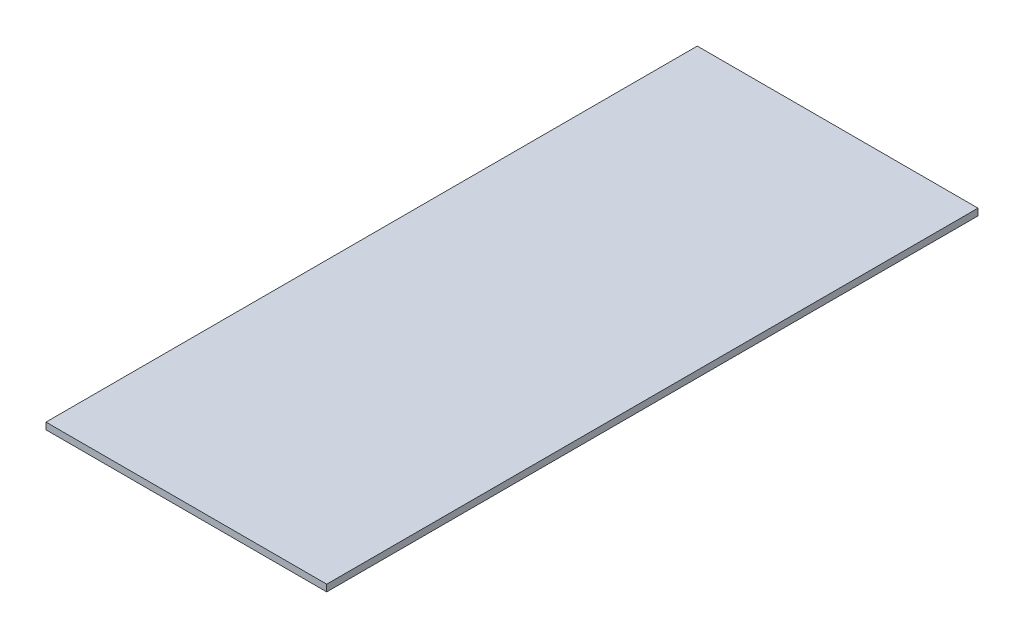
ISO-10303-21;
HEADER;
FILE_DESCRIPTION(('STEP AP214'),'2;1');
FILE_NAME('part.step','',(''),(''),'','','');
FILE_SCHEMA(('AUTOMOTIVE_DESIGN { 1 0 10303 214 1 1 1 1 }'));
ENDSEC;
DATA;
#1=APPLICATION_CONTEXT('core data for automotive mechanical design processes');
#2=APPLICATION_PROTOCOL_DEFINITION('international standard','automotive_design',2000,#1);
#3=PRODUCT_CONTEXT('',#1,'mechanical');
#4=PRODUCT('Part','Part','',(#3));
#5=PRODUCT_RELATED_PRODUCT_CATEGORY('part','',(#4));
#6=PRODUCT_DEFINITION_FORMATION('','',#4);
#7=PRODUCT_DEFINITION_CONTEXT('part definition',#1,'design');
#8=PRODUCT_DEFINITION('design','',#6,#7);
#9=PRODUCT_DEFINITION_SHAPE('','',#8);
#10=(LENGTH_UNIT() NAMED_UNIT(*) SI_UNIT(.MILLI.,.METRE.));
#11=(NAMED_UNIT(*) PLANE_ANGLE_UNIT() SI_UNIT($,.RADIAN.));
#12=(NAMED_UNIT(*) SI_UNIT($,.STERADIAN.) SOLID_ANGLE_UNIT());
#13=UNCERTAINTY_MEASURE_WITH_UNIT(LENGTH_MEASURE(1.E-05),#10,'distance_accuracy_value','');
#14=(GEOMETRIC_REPRESENTATION_CONTEXT(3) GLOBAL_UNCERTAINTY_ASSIGNED_CONTEXT((#13)) GLOBAL_UNIT_ASSIGNED_CONTEXT((#10,
#11,#12)) REPRESENTATION_CONTEXT('',''));
#15=CARTESIAN_POINT('',(0.,0.,0.));
#16=DIRECTION('',(0.,0.,1.));
#17=DIRECTION('',(1.,0.,0.));
#18=AXIS2_PLACEMENT_3D('',#15,#16,#17);
#19=CARTESIAN_POINT('',(0.,6.,0.));
#20=DIRECTION('',(1.,0.,0.));
#21=DIRECTION('',(0.,0.,-1.));
#22=AXIS2_PLACEMENT_3D('',#19,#20,#21);
#23=PLANE('',#22);
#24=DIRECTION('',(0.,0.,1.));
#25=VECTOR('',#24,1.);
#26=CARTESIAN_POINT('',(0.,0.,0.));
#27=LINE('',#26,#25);
#28=CARTESIAN_POINT('',(0.,0.,-105.));
#29=VERTEX_POINT('',#28);
#30=CARTESIAN_POINT('',(0.,0.,475.));
#31=VERTEX_POINT('',#30);
#32=EDGE_CURVE('E101',#29,#31,#27,.T.);
#33=ORIENTED_EDGE('',*,*,#32,.T.);
#34=DIRECTION('',(0.,-1.,0.));
#35=VECTOR('',#34,1.);
#36=CARTESIAN_POINT('',(0.,6.,475.));
#37=LINE('',#36,#35);
#38=CARTESIAN_POINT('',(0.,6.,475.));
#39=VERTEX_POINT('',#38);
#40=EDGE_CURVE('E11',#39,#31,#37,.T.);
#41=ORIENTED_EDGE('',*,*,#40,.F.);
#42=DIRECTION('',(0.,0.,1.));
#43=VECTOR('',#42,1.);
#44=CARTESIAN_POINT('',(0.,6.,0.));
#45=LINE('',#44,#43);
#46=CARTESIAN_POINT('',(0.,6.,-105.));
#47=VERTEX_POINT('',#46);
#48=EDGE_CURVE('E95',#47,#39,#45,.T.);
#49=ORIENTED_EDGE('',*,*,#48,.F.);
#50=DIRECTION('',(0.,1.,0.));
#51=VECTOR('',#50,1.);
#52=CARTESIAN_POINT('',(0.,6.,-105.));
#53=LINE('',#52,#51);
#54=EDGE_CURVE('E106',#29,#47,#53,.T.);
#55=ORIENTED_EDGE('',*,*,#54,.F.);
#56=EDGE_LOOP('',(#33,#41,#49,#55));
#57=FACE_BOUND('',#56,.T.);
#58=ADVANCED_FACE('F45',(#57),#23,.F.);
#59=CARTESIAN_POINT('',(0.,6.,475.));
#60=DIRECTION('',(0.,0.,-1.));
#61=DIRECTION('',(-1.,0.,0.));
#62=AXIS2_PLACEMENT_3D('',#59,#60,#61);
#63=PLANE('',#62);
#64=DIRECTION('',(1.,0.,0.));
#65=VECTOR('',#64,1.);
#66=CARTESIAN_POINT('',(0.,0.,475.));
#67=LINE('',#66,#65);
#68=CARTESIAN_POINT('',(250.,0.,475.));
#69=VERTEX_POINT('',#68);
#70=EDGE_CURVE('E73',#31,#69,#67,.T.);
#71=ORIENTED_EDGE('',*,*,#70,.T.);
#72=DIRECTION('',(0.,-1.,0.));
#73=VECTOR('',#72,1.);
#74=CARTESIAN_POINT('',(250.,6.,475.));
#75=LINE('',#74,#73);
#76=CARTESIAN_POINT('',(250.,6.,475.));
#77=VERTEX_POINT('',#76);
#78=EDGE_CURVE('E54',#77,#69,#75,.T.);
#79=ORIENTED_EDGE('',*,*,#78,.F.);
#80=DIRECTION('',(1.,0.,0.));
#81=VECTOR('',#80,1.);
#82=CARTESIAN_POINT('',(0.,6.,475.));
#83=LINE('',#82,#81);
#84=EDGE_CURVE('E62',#39,#77,#83,.T.);
#85=ORIENTED_EDGE('',*,*,#84,.F.);
#86=ORIENTED_EDGE('',*,*,#40,.T.);
#87=EDGE_LOOP('',(#71,#79,#85,#86));
#88=FACE_BOUND('',#87,.T.);
#89=ADVANCED_FACE('F128',(#88),#63,.F.);
#90=CARTESIAN_POINT('',(250.,6.,0.));
#91=DIRECTION('',(-1.,0.,0.));
#92=DIRECTION('',(0.,0.,1.));
#93=AXIS2_PLACEMENT_3D('',#90,#91,#92);
#94=PLANE('',#93);
#95=DIRECTION('',(0.,0.,-1.));
#96=VECTOR('',#95,1.);
#97=CARTESIAN_POINT('',(250.,0.,0.));
#98=LINE('',#97,#96);
#99=CARTESIAN_POINT('',(250.,0.,-105.));
#100=VERTEX_POINT('',#99);
#101=EDGE_CURVE('E89',#69,#100,#98,.T.);
#102=ORIENTED_EDGE('',*,*,#101,.T.);
#103=DIRECTION('',(0.,-1.,0.));
#104=VECTOR('',#103,1.);
#105=CARTESIAN_POINT('',(250.,6.,-105.));
#106=LINE('',#105,#104);
#107=CARTESIAN_POINT('',(250.,6.,-105.));
#108=VERTEX_POINT('',#107);
#109=EDGE_CURVE('E93',#108,#100,#106,.T.);
#110=ORIENTED_EDGE('',*,*,#109,.F.);
#111=DIRECTION('',(0.,0.,-1.));
#112=VECTOR('',#111,1.);
#113=CARTESIAN_POINT('',(250.,6.,0.));
#114=LINE('',#113,#112);
#115=EDGE_CURVE('E77',#77,#108,#114,.T.);
#116=ORIENTED_EDGE('',*,*,#115,.F.);
#117=ORIENTED_EDGE('',*,*,#78,.T.);
#118=EDGE_LOOP('',(#102,#110,#116,#117));
#119=FACE_BOUND('',#118,.T.);
#120=ADVANCED_FACE('F91',(#119),#94,.F.);
#121=CARTESIAN_POINT('',(0.,6.,0.));
#122=DIRECTION('',(0.,1.,0.));
#123=DIRECTION('',(0.,0.,1.));
#124=AXIS2_PLACEMENT_3D('',#121,#122,#123);
#125=PLANE('',#124);
#126=ORIENTED_EDGE('',*,*,#48,.T.);
#127=ORIENTED_EDGE('',*,*,#84,.T.);
#128=ORIENTED_EDGE('',*,*,#115,.T.);
#129=DIRECTION('',(1.,0.,0.));
#130=VECTOR('',#129,1.);
#131=CARTESIAN_POINT('',(250.,6.,-105.));
#132=LINE('',#131,#130);
#133=EDGE_CURVE('E109',#47,#108,#132,.T.);
#134=ORIENTED_EDGE('',*,*,#133,.F.);
#135=EDGE_LOOP('',(#126,#127,#128,#134));
#136=FACE_BOUND('',#135,.T.);
#137=ADVANCED_FACE('F131',(#136),#125,.T.);
#138=CARTESIAN_POINT('',(0.,0.,0.));
#139=DIRECTION('',(0.,1.,0.));
#140=DIRECTION('',(0.,0.,1.));
#141=AXIS2_PLACEMENT_3D('',#138,#139,#140);
#142=PLANE('',#141);
#143=ORIENTED_EDGE('',*,*,#32,.F.);
#144=DIRECTION('',(-1.,0.,0.));
#145=VECTOR('',#144,1.);
#146=CARTESIAN_POINT('',(250.,0.,-105.));
#147=LINE('',#146,#145);
#148=EDGE_CURVE('E98',#100,#29,#147,.T.);
#149=ORIENTED_EDGE('',*,*,#148,.F.);
#150=ORIENTED_EDGE('',*,*,#101,.F.);
#151=ORIENTED_EDGE('',*,*,#70,.F.);
#152=EDGE_LOOP('',(#143,#149,#150,#151));
#153=FACE_BOUND('',#152,.T.);
#154=ADVANCED_FACE('F99',(#153),#142,.F.);
#155=CARTESIAN_POINT('',(0.,0.,-105.));
#156=DIRECTION('',(0.,0.,-1.));
#157=DIRECTION('',(-1.,0.,0.));
#158=AXIS2_PLACEMENT_3D('',#155,#156,#157);
#159=PLANE('',#158);
#160=ORIENTED_EDGE('',*,*,#109,.T.);
#161=ORIENTED_EDGE('',*,*,#148,.T.);
#162=ORIENTED_EDGE('',*,*,#54,.T.);
#163=ORIENTED_EDGE('',*,*,#133,.T.);
#164=EDGE_LOOP('',(#160,#161,#162,#163));
#165=FACE_BOUND('',#164,.T.);
#166=ADVANCED_FACE('F108',(#165),#159,.T.);
#167=CLOSED_SHELL('',(#58,#89,#120,#137,#154,#166));
#168=MANIFOLD_SOLID_BREP('B2',#167);
#169=ADVANCED_BREP_SHAPE_REPRESENTATION('',(#18,#168),#14);
#170=SHAPE_DEFINITION_REPRESENTATION(#9,#169);
ENDSEC;
END-ISO-10303-21;
